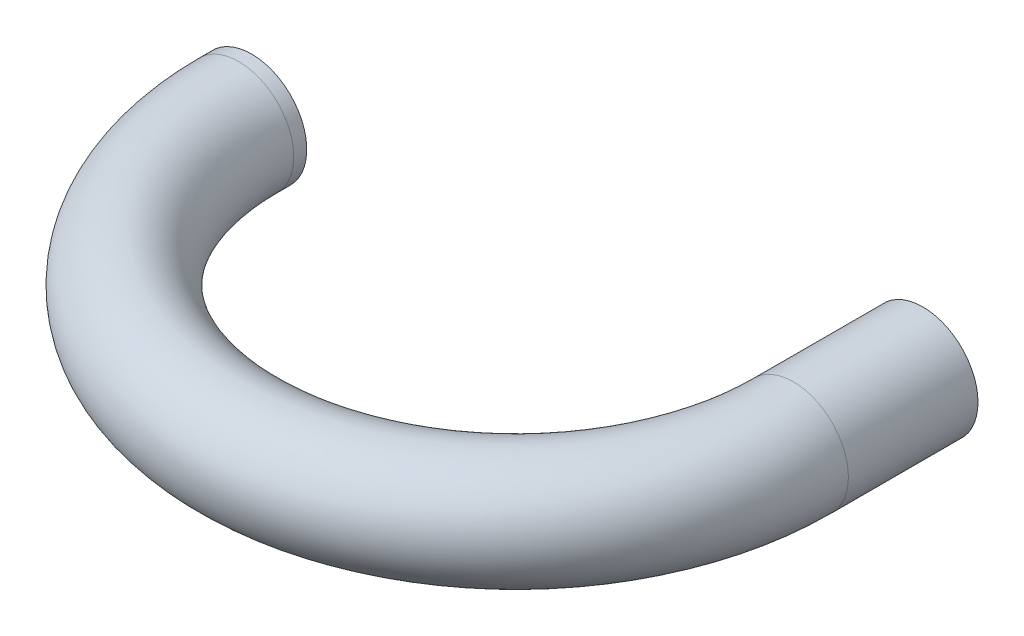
ISO-10303-21;
HEADER;
FILE_DESCRIPTION(('STEP AP214'),'2;1');
FILE_NAME('part.step','',(''),(''),'','','');
FILE_SCHEMA(('AUTOMOTIVE_DESIGN { 1 0 10303 214 1 1 1 1 }'));
ENDSEC;
DATA;
#1=APPLICATION_CONTEXT('core data for automotive mechanical design processes');
#2=APPLICATION_PROTOCOL_DEFINITION('international standard','automotive_design',2000,#1);
#3=PRODUCT_CONTEXT('',#1,'mechanical');
#4=PRODUCT('Part','Part','',(#3));
#5=PRODUCT_RELATED_PRODUCT_CATEGORY('part','',(#4));
#6=PRODUCT_DEFINITION_FORMATION('','',#4);
#7=PRODUCT_DEFINITION_CONTEXT('part definition',#1,'design');
#8=PRODUCT_DEFINITION('design','',#6,#7);
#9=PRODUCT_DEFINITION_SHAPE('','',#8);
#10=(LENGTH_UNIT() NAMED_UNIT(*) SI_UNIT(.MILLI.,.METRE.));
#11=(NAMED_UNIT(*) PLANE_ANGLE_UNIT() SI_UNIT($,.RADIAN.));
#12=(NAMED_UNIT(*) SI_UNIT($,.STERADIAN.) SOLID_ANGLE_UNIT());
#13=UNCERTAINTY_MEASURE_WITH_UNIT(LENGTH_MEASURE(1.E-05),#10,'distance_accuracy_value','');
#14=(GEOMETRIC_REPRESENTATION_CONTEXT(3) GLOBAL_UNCERTAINTY_ASSIGNED_CONTEXT((#13)) GLOBAL_UNIT_ASSIGNED_CONTEXT((#10,
#11,#12)) REPRESENTATION_CONTEXT('',''));
#15=CARTESIAN_POINT('',(0.,0.,0.));
#16=DIRECTION('',(0.,0.,1.));
#17=DIRECTION('',(1.,0.,0.));
#18=AXIS2_PLACEMENT_3D('',#15,#16,#17);
#19=CARTESIAN_POINT('',(0.,0.,0.));
#20=DIRECTION('',(0.,-1.,0.));
#21=DIRECTION('',(0.,0.,-1.));
#22=AXIS2_PLACEMENT_3D('',#19,#20,#21);
#23=TOROIDAL_SURFACE('',#22,214.,42.5);
#24=CARTESIAN_POINT('',(214.,0.,-3.01491633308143E-12));
#25=DIRECTION('',(0.,0.,-1.));
#26=DIRECTION('',(-1.,0.,0.));
#27=AXIS2_PLACEMENT_3D('',#24,#25,#26);
#28=CIRCLE('',#27,42.5);
#29=CARTESIAN_POINT('',(256.5,0.,-3.61367308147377E-12));
#30=VERTEX_POINT('',#29);
#31=EDGE_CURVE('E9',#30,#30,#28,.T.);
#32=CARTESIAN_POINT('',(-214.,0.,0.));
#33=DIRECTION('',(0.,0.,1.));
#34=DIRECTION('',(1.,0.,0.));
#35=AXIS2_PLACEMENT_3D('',#32,#33,#34);
#36=CIRCLE('',#35,42.5);
#37=CARTESIAN_POINT('',(-256.5,0.,0.));
#38=VERTEX_POINT('',#37);
#39=EDGE_CURVE('E19',#38,#38,#36,.T.);
#40=CARTESIAN_POINT('',(0.,0.,0.));
#41=DIRECTION('',(0.,-1.,0.));
#42=DIRECTION('',(0.,0.,-1.));
#43=AXIS2_PLACEMENT_3D('',#40,#41,#42);
#44=CIRCLE('',#43,256.5);
#45=EDGE_CURVE('',#30,#38,#44,.T.);
#46=ORIENTED_EDGE('',*,*,#31,.F.);
#47=ORIENTED_EDGE('',*,*,#39,.T.);
#48=ORIENTED_EDGE('',*,*,#45,.T.);
#49=ORIENTED_EDGE('',*,*,#45,.F.);
#50=EDGE_LOOP('',(#46,#48,#47,#49));
#51=FACE_BOUND('',#50,.T.);
#52=ADVANCED_FACE('F13',(#51),#23,.T.);
#53=CARTESIAN_POINT('',(-214.,0.,-10.));
#54=DIRECTION('',(0.,0.,1.));
#55=DIRECTION('',(1.,0.,0.));
#56=AXIS2_PLACEMENT_3D('',#53,#54,#55);
#57=CYLINDRICAL_SURFACE('',#56,42.5);
#58=CARTESIAN_POINT('',(-214.,0.,-10.));
#59=DIRECTION('',(0.,0.,-1.));
#60=DIRECTION('',(-1.,0.,0.));
#61=AXIS2_PLACEMENT_3D('',#58,#59,#60);
#62=CIRCLE('',#61,42.5);
#63=CARTESIAN_POINT('',(-256.5,0.,-10.));
#64=VERTEX_POINT('',#63);
#65=EDGE_CURVE('E23',#64,#64,#62,.T.);
#66=ORIENTED_EDGE('',*,*,#65,.F.);
#67=EDGE_LOOP('',(#66));
#68=FACE_BOUND('',#67,.T.);
#69=ORIENTED_EDGE('',*,*,#39,.F.);
#70=EDGE_LOOP('',(#69));
#71=FACE_BOUND('',#70,.T.);
#72=ADVANCED_FACE('F46',(#68,#71),#57,.T.);
#73=CARTESIAN_POINT('',(-214.,0.,-10.));
#74=DIRECTION('',(0.,0.,-1.));
#75=DIRECTION('',(-1.,0.,0.));
#76=AXIS2_PLACEMENT_3D('',#73,#74,#75);
#77=PLANE('',#76);
#78=ORIENTED_EDGE('',*,*,#65,.T.);
#79=EDGE_LOOP('',(#78));
#80=FACE_BOUND('',#79,.T.);
#81=ADVANCED_FACE('F37',(#80),#77,.T.);
#82=CARTESIAN_POINT('',(214.,0.,-100.000000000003));
#83=DIRECTION('',(0.,0.,1.));
#84=DIRECTION('',(1.,0.,0.));
#85=AXIS2_PLACEMENT_3D('',#82,#83,#84);
#86=CYLINDRICAL_SURFACE('',#85,42.5);
#87=CARTESIAN_POINT('',(214.,0.,-100.000000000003));
#88=DIRECTION('',(0.,0.,-1.));
#89=DIRECTION('',(-1.,0.,0.));
#90=AXIS2_PLACEMENT_3D('',#87,#88,#89);
#91=CIRCLE('',#90,42.5);
#92=CARTESIAN_POINT('',(171.5,0.,-100.000000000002));
#93=VERTEX_POINT('',#92);
#94=EDGE_CURVE('E27',#93,#93,#91,.T.);
#95=ORIENTED_EDGE('',*,*,#94,.F.);
#96=EDGE_LOOP('',(#95));
#97=FACE_BOUND('',#96,.T.);
#98=ORIENTED_EDGE('',*,*,#31,.T.);
#99=EDGE_LOOP('',(#98));
#100=FACE_BOUND('',#99,.T.);
#101=ADVANCED_FACE('F35',(#97,#100),#86,.T.);
#102=CARTESIAN_POINT('',(214.,0.,-100.000000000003));
#103=DIRECTION('',(0.,0.,-1.));
#104=DIRECTION('',(-1.,0.,0.));
#105=AXIS2_PLACEMENT_3D('',#102,#103,#104);
#106=PLANE('',#105);
#107=ORIENTED_EDGE('',*,*,#94,.T.);
#108=EDGE_LOOP('',(#107));
#109=FACE_BOUND('',#108,.T.);
#110=ADVANCED_FACE('F33',(#109),#106,.T.);
#111=CLOSED_SHELL('',(#52,#72,#81,#101,#110));
#112=MANIFOLD_SOLID_BREP('B1',#111);
#113=ADVANCED_BREP_SHAPE_REPRESENTATION('',(#18,#112),#14);
#114=SHAPE_DEFINITION_REPRESENTATION(#9,#113);
ENDSEC;
END-ISO-10303-21;
